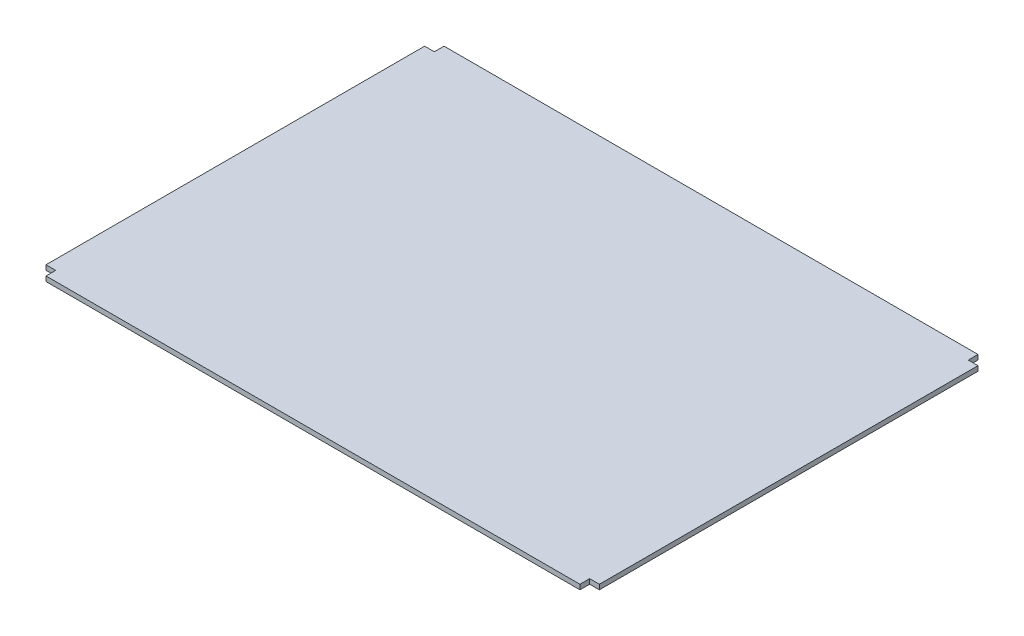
from build123d import *

# Parameters (mm, degrees)
SKETCH1_W           = 723.9
SKETCH1_H           = 520.7
BOSS_EXTRUDE1_DEPTH = 6.35
SKETCH2_W           = 12.7
SKETCH2_H           = 12.7
CUT_EXTRUDE1_DEPTH  = 446.903854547


with BuildPart() as part:
    # Sketch1 → Boss-Extrude1 (new body)
    with BuildSketch(Plane(origin=(0, 0, 0), x_dir=(1, 0, 0), z_dir=(0, 1, 0))):
        Rectangle(SKETCH1_W, SKETCH1_H)
    extrude(amount=BOSS_EXTRUDE1_DEPTH)

    # Sketch2 → Cut-Extrude1 (cut, through all)
    with BuildSketch(Plane(origin=(0, 6.35, 0), x_dir=(1, 0, 0), z_dir=(0, 1, 0))):
        with Locations((-355.6, -254)):
            Rectangle(SKETCH2_W, SKETCH2_H)
        with Locations((-355.6, 254)):
            Rectangle(SKETCH2_W, SKETCH2_H)
        with Locations((355.6, 254)):
            Rectangle(SKETCH2_W, SKETCH2_H)
        with Locations((355.6, -254)):
            Rectangle(SKETCH2_W, SKETCH2_H)
    extrude(amount=-CUT_EXTRUDE1_DEPTH, mode=Mode.SUBTRACT)


solid = part.part
